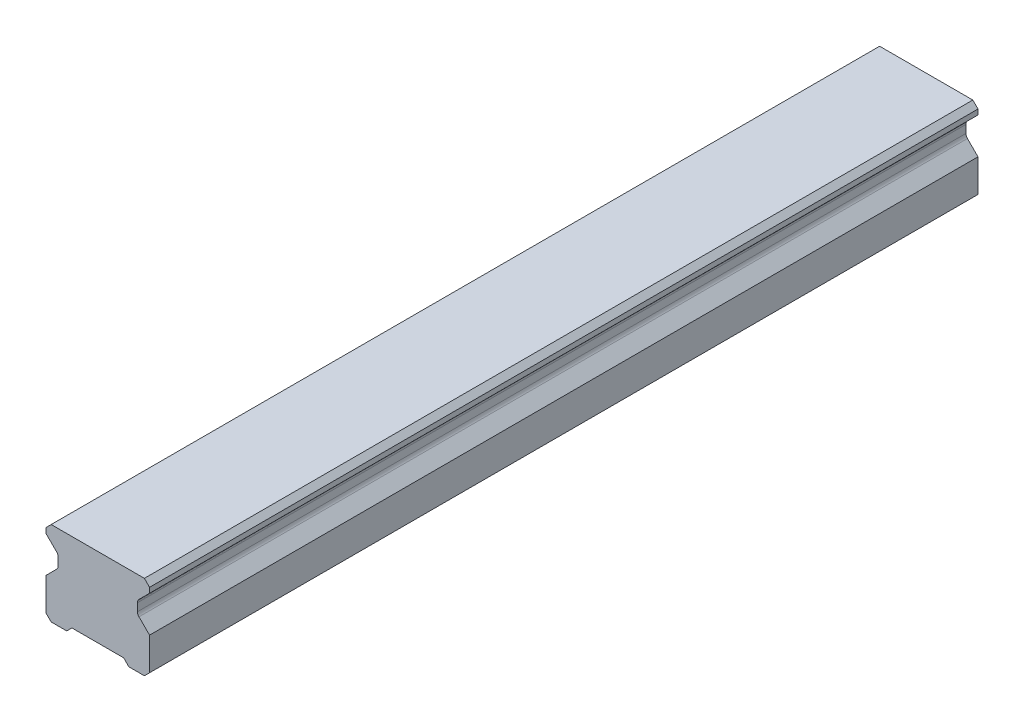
from build123d import *

# Parameters (mm, degrees)
SKETCH1_W           = 20
SKETCH1_H           = 16.3
BOSS_EXTRUDE1_DEPTH = 80
CUT_EXTRUDE1_DEPTH  = 162.13872905
CHAMFER1_SIZE       = 1
FILLET1_R           = 1
CUT_EXTRUDE2_DEPTH  = 162.13872905
SKETCH5_R           = 3
SKETCH5_R_2         = 2.5
CUT_EXTRUDE5_DEPTH  = 10
SKETCH5_2_R         = 2.5
CUT_EXTRUDE6_DEPTH  = 13
LPATTERN2_COUNT     = 3
LPATTERN2_PITCH     = 60


with BuildPart() as part:
    # Sketch1 → Boss-Extrude1 (new, symmetric)
    with BuildSketch(Plane.XY):
        with Locations((0, 8.15)):
            Rectangle(SKETCH1_W, SKETCH1_H)
    extrude(amount=BOSS_EXTRUDE1_DEPTH, both=True)

    # Sketch2 → Cut-Extrude1 (cut, through all)
    with BuildSketch(Plane.XY.offset(80)):
        Polygon((-10, 14.3), (-10, 7.3), (-7.666666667, 9.633333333), (-7.666666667, 11.966666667), align=None)
        Polygon((7.666666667, 11.966666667), (10, 14.3), (10, 7.3), (7.666666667, 9.633333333), align=None)
    extrude(amount=-CUT_EXTRUDE1_DEPTH, mode=Mode.SUBTRACT)

    # Chamfer1
    chamfer1_edges = [part.edges().sort_by_distance(p)[0] for p in [
        (-10, 16.3, 0),
        (10, 16.3, 0),
        (10, 0, 0),
        (-10, 0, 0),
    ]]
    chamfer(chamfer1_edges, length=CHAMFER1_SIZE)

    # Fillet1
    fillet1_edges = [part.edges().sort_by_distance(p)[0] for p in [
        (-7.666666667, 11.966666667, 0),
        (-7.666666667, 9.633333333, 0),
        (7.666666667, 9.633333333, 0),
        (7.666666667, 11.966666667, 0),
    ]]
    fillet(fillet1_edges, radius=FILLET1_R)

    # Sketch3 → Cut-Extrude2 (cut, through all)
    with BuildSketch(Plane.XY.offset(80)):
        Polygon((-6, 0), (-5, 1), (5, 1), (6, 0), align=None)
    extrude(amount=-CUT_EXTRUDE2_DEPTH, mode=Mode.SUBTRACT)

    # Sketch5 → Cut-Extrude5 (cut)
    with BuildSketch(Plane.XZ.offset(-1)):
        with Locations(Location((0, 60, 0), (0, 0, 270))):
            Circle(SKETCH5_R)
        with Locations(Location((0, 60, 0), (0, 0, 270))):
            Circle(SKETCH5_R_2, mode=Mode.SUBTRACT)
    cut_extrude5 = extrude(amount=-CUT_EXTRUDE5_DEPTH, mode=Mode.SUBTRACT)

    # Sketch5_2 → Cut-Extrude6 (cut)
    with BuildSketch(Plane.XZ.offset(-1)):
        with Locations(Location((0, 60, 0), (0, 0, 270))):
            Circle(SKETCH5_2_R)
    cut_extrude6 = extrude(amount=-CUT_EXTRUDE6_DEPTH, mode=Mode.SUBTRACT)

    # Cut-Extrude7 cone 1 section (on through the dimple's axis) → Cut-Extrude7 (revolve, cut)
    with BuildSketch(Plane(origin=(0, 14, 60), x_dir=(0, 0, -1), z_dir=(1, 0, 0))):
        Polygon((0, 0), (2.5, 0), (0, 1.443375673), align=None)
    cut_extrude7 = revolve(axis=Axis((0, 14, 60), (0, 1, 0)), mode=Mode.SUBTRACT)

    # LPattern2: Cut-Extrude5, Cut-Extrude6, Cut-Extrude7 ×3
    with Locations(*[(0, 0, -i * LPATTERN2_PITCH) for i in range(1, LPATTERN2_COUNT)]):
        add(cut_extrude5, mode=Mode.SUBTRACT)
        add(cut_extrude6, mode=Mode.SUBTRACT)
        add(cut_extrude7, mode=Mode.SUBTRACT)


solid = part.part
